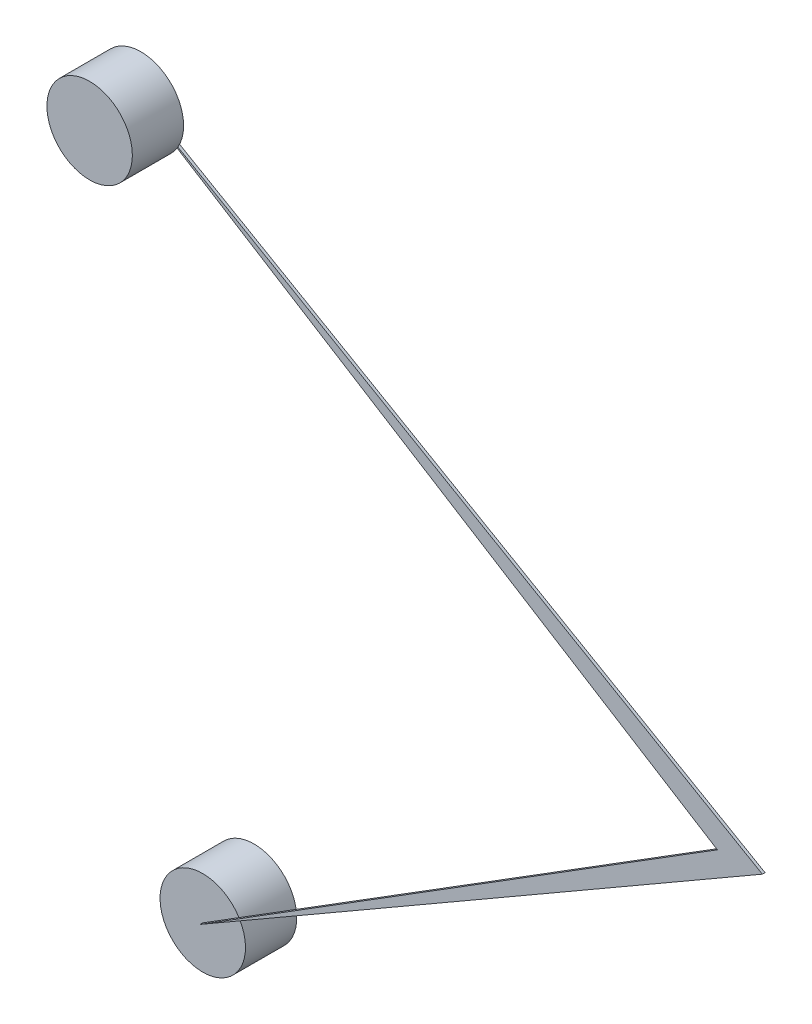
from build123d import *

# Parameters (mm, degrees)
EXTRUDE1_DEPTH = 1
SKETCH2_R      = 15.875
EXTRUDE2_DEPTH = 19.05
SKETCH3_R      = 15.875
EXTRUDE3_DEPTH = 19.05


with BuildPart() as part:
    # Sketch1 → Extrude1 (new body)
    with BuildSketch(Plane.XY):
        Polygon((0, 0), (-230.968975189, 133.35), (-16.727967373, -0.522639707), (-208.971929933, -120.65), align=None)
    extrude(amount=EXTRUDE1_DEPTH)

    # Sketch2 → Extrude2 (add)
    with BuildSketch(Plane.XY.offset(1)):
        with Locations(Location((-230.968975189, 133.35, 0), (0, 0, 328))):
            Circle(SKETCH2_R)
    extrude(amount=EXTRUDE2_DEPTH)

    # Sketch3 → Extrude3 (add)
    with BuildSketch(Plane(origin=(0, 0, 0), x_dir=(-1, 0, 0), z_dir=(0, 0, -1))):
        with Locations(Location((208.971929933, -120.65, 0), (0, 0, 150))):
            Circle(SKETCH3_R)
    extrude(amount=EXTRUDE3_DEPTH)


solid = part.part
